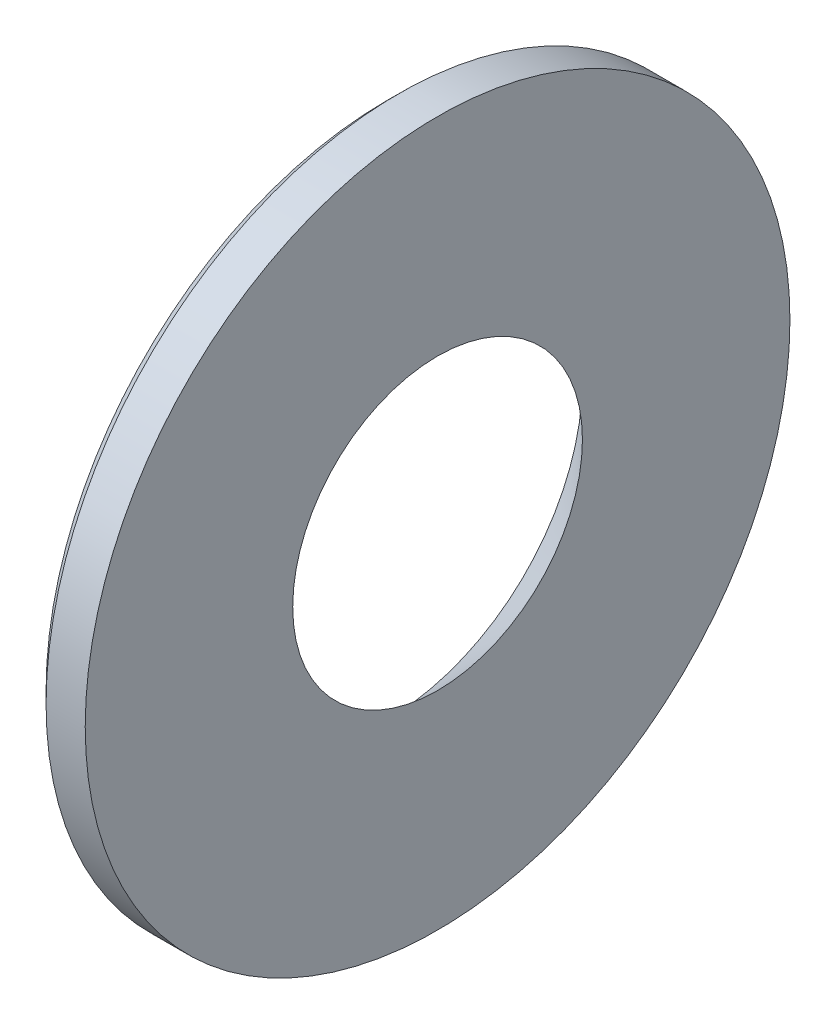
ISO-10303-21;
HEADER;
FILE_DESCRIPTION(('STEP AP214'),'2;1');
FILE_NAME('part.step','',(''),(''),'','','');
FILE_SCHEMA(('AUTOMOTIVE_DESIGN { 1 0 10303 214 1 1 1 1 }'));
ENDSEC;
DATA;
#1=APPLICATION_CONTEXT('core data for automotive mechanical design processes');
#2=APPLICATION_PROTOCOL_DEFINITION('international standard','automotive_design',2000,#1);
#3=PRODUCT_CONTEXT('',#1,'mechanical');
#4=PRODUCT('Part','Part','',(#3));
#5=PRODUCT_RELATED_PRODUCT_CATEGORY('part','',(#4));
#6=PRODUCT_DEFINITION_FORMATION('','',#4);
#7=PRODUCT_DEFINITION_CONTEXT('part definition',#1,'design');
#8=PRODUCT_DEFINITION('design','',#6,#7);
#9=PRODUCT_DEFINITION_SHAPE('','',#8);
#10=(LENGTH_UNIT() NAMED_UNIT(*) SI_UNIT(.MILLI.,.METRE.));
#11=(NAMED_UNIT(*) PLANE_ANGLE_UNIT() SI_UNIT($,.RADIAN.));
#12=(NAMED_UNIT(*) SI_UNIT($,.STERADIAN.) SOLID_ANGLE_UNIT());
#13=UNCERTAINTY_MEASURE_WITH_UNIT(LENGTH_MEASURE(1.E-05),#10,'distance_accuracy_value','');
#14=(GEOMETRIC_REPRESENTATION_CONTEXT(3) GLOBAL_UNCERTAINTY_ASSIGNED_CONTEXT((#13)) GLOBAL_UNIT_ASSIGNED_CONTEXT((#10,
#11,#12)) REPRESENTATION_CONTEXT('',''));
#15=CARTESIAN_POINT('',(0.,0.,0.));
#16=DIRECTION('',(0.,0.,1.));
#17=DIRECTION('',(1.,0.,0.));
#18=AXIS2_PLACEMENT_3D('',#15,#16,#17);
#19=CARTESIAN_POINT('',(-1.0000000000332,0.,0.));
#20=DIRECTION('',(1.,0.,0.));
#21=DIRECTION('',(0.,0.,-1.));
#22=AXIS2_PLACEMENT_3D('',#19,#20,#21);
#23=CONICAL_SURFACE('',#22,8.99999999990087,0.785398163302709);
#24=CARTESIAN_POINT('',(-1.,0.,0.));
#25=DIRECTION('',(1.,0.,0.));
#26=DIRECTION('',(0.,0.,-1.));
#27=AXIS2_PLACEMENT_3D('',#24,#25,#26);
#28=CIRCLE('',#27,9.);
#29=CARTESIAN_POINT('',(-1.,0.,-9.));
#30=VERTEX_POINT('',#29);
#31=EDGE_CURVE('E30',#30,#30,#28,.T.);
#32=ORIENTED_EDGE('',*,*,#31,.F.);
#33=EDGE_LOOP('',(#32));
#34=FACE_BOUND('',#33,.T.);
#35=CARTESIAN_POINT('',(-1.30000000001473,0.,0.));
#36=DIRECTION('',(1.,0.,0.));
#37=DIRECTION('',(0.,0.,-1.));
#38=AXIS2_PLACEMENT_3D('',#35,#36,#37);
#39=CIRCLE('',#38,8.69999999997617);
#40=CARTESIAN_POINT('',(-1.30000000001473,0.,-8.69999999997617));
#41=VERTEX_POINT('',#40);
#42=EDGE_CURVE('E18',#41,#41,#39,.T.);
#43=ORIENTED_EDGE('',*,*,#42,.T.);
#44=EDGE_LOOP('',(#43));
#45=FACE_BOUND('',#44,.T.);
#46=ADVANCED_FACE('F15',(#34,#45),#23,.T.);
#47=CARTESIAN_POINT('',(-1.3,0.,0.));
#48=DIRECTION('',(1.,0.,0.));
#49=DIRECTION('',(0.,0.,-1.));
#50=AXIS2_PLACEMENT_3D('',#47,#48,#49);
#51=PLANE('',#50);
#52=CARTESIAN_POINT('',(-1.29999999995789,0.,0.));
#53=DIRECTION('',(-1.,0.,0.));
#54=DIRECTION('',(0.,0.,1.));
#55=AXIS2_PLACEMENT_3D('',#52,#53,#54);
#56=CIRCLE('',#55,4.99999999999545);
#57=CARTESIAN_POINT('',(-1.29999999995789,0.,4.99999999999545));
#58=VERTEX_POINT('',#57);
#59=EDGE_CURVE('E27',#58,#58,#56,.F.);
#60=ORIENTED_EDGE('',*,*,#59,.T.);
#61=EDGE_LOOP('',(#60));
#62=FACE_BOUND('',#61,.T.);
#63=ORIENTED_EDGE('',*,*,#42,.F.);
#64=EDGE_LOOP('',(#63));
#65=FACE_BOUND('',#64,.T.);
#66=ADVANCED_FACE('F41',(#62,#65),#51,.F.);
#67=CARTESIAN_POINT('',(-1.365,0.,0.));
#68=DIRECTION('',(1.,0.,0.));
#69=DIRECTION('',(0.,0.,-1.));
#70=AXIS2_PLACEMENT_3D('',#67,#68,#69);
#71=CYLINDRICAL_SURFACE('',#70,9.);
#72=CARTESIAN_POINT('',(0.,0.,0.));
#73=DIRECTION('',(1.,0.,0.));
#74=DIRECTION('',(0.,0.,-1.));
#75=AXIS2_PLACEMENT_3D('',#72,#73,#74);
#76=CIRCLE('',#75,9.);
#77=CARTESIAN_POINT('',(0.,0.,-9.));
#78=VERTEX_POINT('',#77);
#79=EDGE_CURVE('E22',#78,#78,#76,.T.);
#80=ORIENTED_EDGE('',*,*,#79,.F.);
#81=EDGE_LOOP('',(#80));
#82=FACE_BOUND('',#81,.T.);
#83=ORIENTED_EDGE('',*,*,#31,.T.);
#84=EDGE_LOOP('',(#83));
#85=FACE_BOUND('',#84,.T.);
#86=ADVANCED_FACE('F43',(#82,#85),#71,.T.);
#87=CARTESIAN_POINT('',(-1.29999999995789,0.,0.));
#88=DIRECTION('',(-1.,0.,0.));
#89=DIRECTION('',(0.,0.,1.));
#90=AXIS2_PLACEMENT_3D('',#87,#88,#89);
#91=CONICAL_SURFACE('',#90,4.99999999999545,0.785398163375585);
#92=CARTESIAN_POINT('',(5.6843418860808E-11,0.,0.));
#93=DIRECTION('',(-1.,0.,0.));
#94=DIRECTION('',(0.,0.,1.));
#95=AXIS2_PLACEMENT_3D('',#92,#93,#94);
#96=CIRCLE('',#95,3.70000000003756);
#97=CARTESIAN_POINT('',(5.6843418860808E-11,0.,3.70000000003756));
#98=VERTEX_POINT('',#97);
#99=EDGE_CURVE('E10',#98,#98,#96,.T.);
#100=ORIENTED_EDGE('',*,*,#99,.F.);
#101=EDGE_LOOP('',(#100));
#102=FACE_BOUND('',#101,.T.);
#103=ORIENTED_EDGE('',*,*,#59,.F.);
#104=EDGE_LOOP('',(#103));
#105=FACE_BOUND('',#104,.T.);
#106=ADVANCED_FACE('F49',(#102,#105),#91,.F.);
#107=CARTESIAN_POINT('',(0.,0.,0.));
#108=DIRECTION('',(1.,0.,0.));
#109=DIRECTION('',(0.,0.,-1.));
#110=AXIS2_PLACEMENT_3D('',#107,#108,#109);
#111=PLANE('',#110);
#112=ORIENTED_EDGE('',*,*,#99,.T.);
#113=EDGE_LOOP('',(#112));
#114=FACE_BOUND('',#113,.T.);
#115=ORIENTED_EDGE('',*,*,#79,.T.);
#116=EDGE_LOOP('',(#115));
#117=FACE_BOUND('',#116,.T.);
#118=ADVANCED_FACE('F53',(#114,#117),#111,.T.);
#119=CLOSED_SHELL('',(#46,#66,#86,#106,#118));
#120=MANIFOLD_SOLID_BREP('B1',#119);
#121=ADVANCED_BREP_SHAPE_REPRESENTATION('',(#18,#120),#14);
#122=SHAPE_DEFINITION_REPRESENTATION(#9,#121);
ENDSEC;
END-ISO-10303-21;
